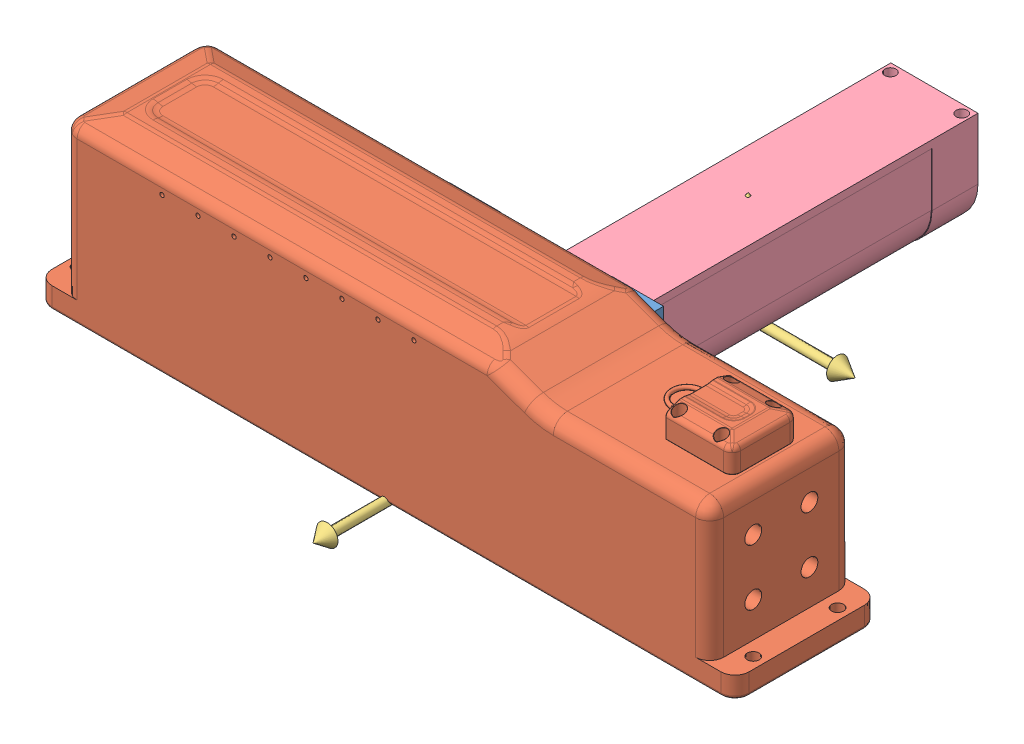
SolidWorks assembly ResonAssembly.SLDASM, configuration Default (file format 11000). Lengths in mm.
Overall size (496 152.16 440.72).
5 component instances, 4 part files, 9 mates.
Components (placement in the parent):
- Trans-Recv mount-1: Trans-Recv mount.SLDPRT [Default] at (-52.1462 126.2388 98.6305) size (152.4 38.1 19.05)
- RESON 7200E921_EM7200_Dummy-1: RESON 7200E921_EM7200_Dummy.SLDPRT [Default] at (-282.1461 154.4136 104.9805) x (1 0 0) z (0 -1 0) size (496 102 131)
- CoordSystem-1: CoordSystem.SLDPRT [Default] at (-53.5461 27.4136 181.5805) x (0 0 1) z (0 1 0) size (83.82 83.82 83.82)
- CoordSystem-3: CoordSystem.SLDPRT [Default] at (-52.1462 13.8706 -50.3345) x (0 0 1) z (0 1 0) size (83.82 83.82 83.82)
- RESON TC2160 Projector-3: RESON TC2160 Projector.SLDPRT [Default] at (-52.1462 44.4388 102.0655) x (0 0 -1) z (-1 0 0) size (285 74.7 62)
Mates (geometry in assembly coordinates):
- Coincident3: coincident: plane of Trans-Recv mount-1 through (-128.3462 88.1388 104.9805) normal (0 0 1); plane of RESON 7200E921_EM7200_Dummy-1 through (-290.1461 141.7378 104.9805) normal (0 0 -1)
- Concentric4: concentric: cylinder of Trans-Recv mount-1 through (-2.1463 115.1136 66.8805) axis (0 0 1) radius 4.445; cylinder of RESON 7200E921_EM7200_Dummy-1 through (-2.1461 115.1136 115.1805) axis (0 0 -1) radius 6
- Concentric5: concentric: cylinder of Trans-Recv mount-1 through (-102.1461 115.1136 66.8805) axis (0 0 1) radius 4.445; cylinder of RESON 7200E921_EM7200_Dummy-1 through (-102.1461 115.1136 115.1805) axis (0 0 -1) radius 6
- Coincident5: coincident: plane of RESON 7200E921_EM7200_Dummy-1 through (-298.1461 27.4136 106.9805) normal (0 -1 0); plane of CoordSystem-1 through (-53.5461 27.4136 181.5805) normal (0 1 0)
- Distance4: distance = 25.4 mm: plane of CoordSystem-1 through (-53.5461 27.4136 181.5805) normal (0 0 1); plane of RESON 7200E921_EM7200_Dummy-1 through (-290.1461 29.4136 206.9805) normal (0 0 1)
- Distance5: distance = 228.6 mm: plane of CoordSystem-1 through (-53.5461 27.4136 181.5805) normal (1 0 0); plane of RESON 7200E921_EM7200_Dummy-1 through (-282.1461 42.4136 114.9805) normal (-1 0 0)
- Coincident6: coincident: plane of Trans-Recv mount-1 through (-52.1462 88.1388 98.6305) normal (0 -1 0); plane of RESON TC2160 Projector-3 through (-141.2722 88.1388 -175.6176) normal (0 1 0)
- Concentric6: concentric: cylinder of Trans-Recv mount-1 through (-77.5462 88.1388 96.0905) axis (0 1 0) radius 4.445; circle of RESON TC2160 Projector-3
- Parallel1: parallel: plane of RESON 7200E921_EM7200_Dummy-1 through (-290.1463 141.7378 104.9805) normal (0 0 -1); plane of RESON TC2160 Projector-3 through (-52.1462 44.4388 102.0655) normal (0 0 1)
